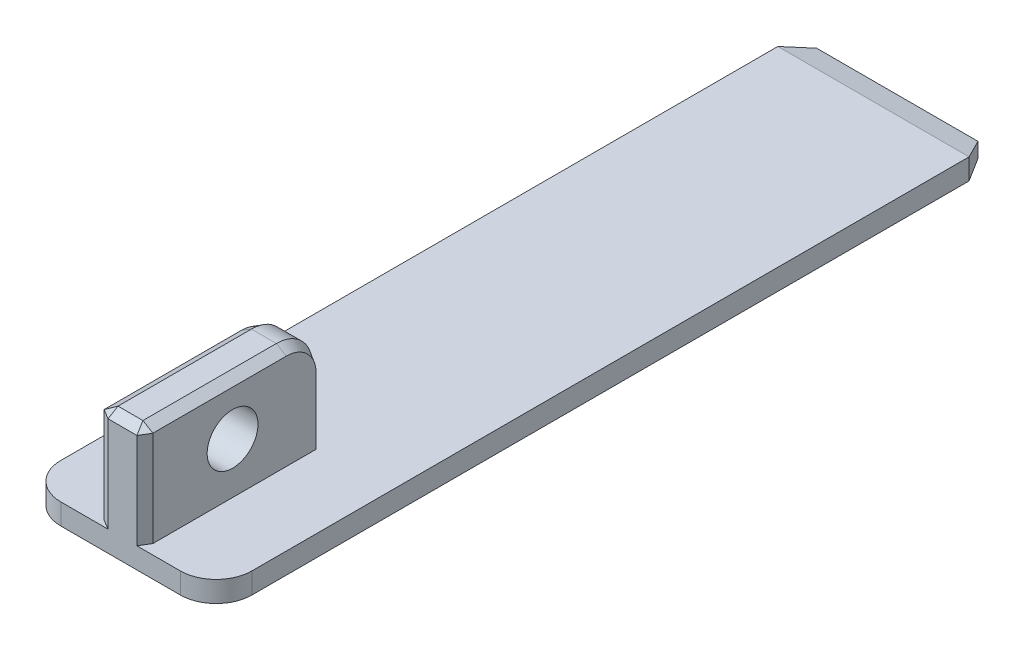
ISO-10303-21;
HEADER;
FILE_DESCRIPTION(('STEP AP214'),'2;1');
FILE_NAME('part.step','',(''),(''),'','','');
FILE_SCHEMA(('AUTOMOTIVE_DESIGN { 1 0 10303 214 1 1 1 1 }'));
ENDSEC;
DATA;
#1=APPLICATION_CONTEXT('core data for automotive mechanical design processes');
#2=APPLICATION_PROTOCOL_DEFINITION('international standard','automotive_design',2000,#1);
#3=PRODUCT_CONTEXT('',#1,'mechanical');
#4=PRODUCT('Part','Part','',(#3));
#5=PRODUCT_RELATED_PRODUCT_CATEGORY('part','',(#4));
#6=PRODUCT_DEFINITION_FORMATION('','',#4);
#7=PRODUCT_DEFINITION_CONTEXT('part definition',#1,'design');
#8=PRODUCT_DEFINITION('design','',#6,#7);
#9=PRODUCT_DEFINITION_SHAPE('','',#8);
#10=(LENGTH_UNIT() NAMED_UNIT(*) SI_UNIT(.MILLI.,.METRE.));
#11=(NAMED_UNIT(*) PLANE_ANGLE_UNIT() SI_UNIT($,.RADIAN.));
#12=(NAMED_UNIT(*) SI_UNIT($,.STERADIAN.) SOLID_ANGLE_UNIT());
#13=UNCERTAINTY_MEASURE_WITH_UNIT(LENGTH_MEASURE(1.E-05),#10,'distance_accuracy_value','');
#14=(GEOMETRIC_REPRESENTATION_CONTEXT(3) GLOBAL_UNCERTAINTY_ASSIGNED_CONTEXT((#13)) GLOBAL_UNIT_ASSIGNED_CONTEXT((#10,
#11,#12)) REPRESENTATION_CONTEXT('',''));
#15=CARTESIAN_POINT('',(0.,0.,0.));
#16=DIRECTION('',(0.,0.,1.));
#17=DIRECTION('',(1.,0.,0.));
#18=AXIS2_PLACEMENT_3D('',#15,#16,#17);
#19=CARTESIAN_POINT('',(-16.,1.75,130.));
#20=DIRECTION('',(0.,-1.,0.));
#21=DIRECTION('',(0.,0.,-1.));
#22=AXIS2_PLACEMENT_3D('',#19,#20,#21);
#23=PLANE('',#22);
#24=DIRECTION('',(0.,0.,-1.));
#25=VECTOR('',#24,1.);
#26=CARTESIAN_POINT('',(-16.,1.75,130.));
#27=LINE('',#26,#25);
#28=CARTESIAN_POINT('',(-16.,1.75,124.));
#29=VERTEX_POINT('',#28);
#30=CARTESIAN_POINT('',(-16.,1.75,4.00000000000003));
#31=VERTEX_POINT('',#30);
#32=EDGE_CURVE('E184',#29,#31,#27,.T.);
#33=ORIENTED_EDGE('',*,*,#32,.F.);
#34=CARTESIAN_POINT('',(-10.,1.75,124.));
#35=DIRECTION('',(0.,-1.,0.));
#36=DIRECTION('',(0.,0.,-1.));
#37=AXIS2_PLACEMENT_3D('',#34,#35,#36);
#38=CIRCLE('',#37,6.);
#39=CARTESIAN_POINT('',(-10.,1.75,130.));
#40=VERTEX_POINT('',#39);
#41=EDGE_CURVE('E245',#29,#40,#38,.F.);
#42=ORIENTED_EDGE('',*,*,#41,.T.);
#43=DIRECTION('',(-1.,0.,0.));
#44=VECTOR('',#43,1.);
#45=CARTESIAN_POINT('',(-16.,1.75,130.));
#46=LINE('',#45,#44);
#47=CARTESIAN_POINT('',(-2.0857205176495,1.75,130.));
#48=VERTEX_POINT('',#47);
#49=EDGE_CURVE('E341',#48,#40,#46,.T.);
#50=ORIENTED_EDGE('',*,*,#49,.F.);
#51=DIRECTION('',(-0.857167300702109,0.,-0.515038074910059));
#52=VECTOR('',#51,1.);
#53=CARTESIAN_POINT('',(-12.3090395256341,1.75,123.857210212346));
#54=LINE('',#53,#52);
#55=CARTESIAN_POINT('',(-3.75,1.75,129.));
#56=VERTEX_POINT('',#55);
#57=EDGE_CURVE('E11',#48,#56,#54,.T.);
#58=ORIENTED_EDGE('',*,*,#57,.T.);
#59=DIRECTION('',(0.,0.,1.));
#60=VECTOR('',#59,1.);
#61=CARTESIAN_POINT('',(-3.75,1.75,130.));
#62=LINE('',#61,#60);
#63=CARTESIAN_POINT('',(-3.75,1.75,101.));
#64=VERTEX_POINT('',#63);
#65=EDGE_CURVE('E334',#64,#56,#62,.T.);
#66=ORIENTED_EDGE('',*,*,#65,.F.);
#67=DIRECTION('',(-0.857167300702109,0.,0.515038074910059));
#68=VECTOR('',#67,1.);
#69=CARTESIAN_POINT('',(-25.553253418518,1.75,114.100716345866));
#70=LINE('',#69,#68);
#71=CARTESIAN_POINT('',(-2.0857205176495,1.75,100.));
#72=VERTEX_POINT('',#71);
#73=EDGE_CURVE('E287',#64,#72,#70,.F.);
#74=ORIENTED_EDGE('',*,*,#73,.T.);
#75=DIRECTION('',(-1.,0.,0.));
#76=VECTOR('',#75,1.);
#77=CARTESIAN_POINT('',(-3.75,1.75,100.));
#78=LINE('',#77,#76);
#79=CARTESIAN_POINT('',(2.0857205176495,1.75,100.));
#80=VERTEX_POINT('',#79);
#81=EDGE_CURVE('E331',#80,#72,#78,.T.);
#82=ORIENTED_EDGE('',*,*,#81,.F.);
#83=DIRECTION('',(-0.857167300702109,0.,-0.515038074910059));
#84=VECTOR('',#83,1.);
#85=CARTESIAN_POINT('',(2.04170841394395,1.75,99.9735548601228));
#86=LINE('',#85,#84);
#87=CARTESIAN_POINT('',(3.75,1.75,101.));
#88=VERTEX_POINT('',#87);
#89=EDGE_CURVE('E285',#80,#88,#86,.F.);
#90=ORIENTED_EDGE('',*,*,#89,.T.);
#91=DIRECTION('',(0.,0.,-1.));
#92=VECTOR('',#91,1.);
#93=CARTESIAN_POINT('',(3.75,1.75,130.));
#94=LINE('',#93,#92);
#95=CARTESIAN_POINT('',(3.75,1.75,128.33572051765));
#96=VERTEX_POINT('',#95);
#97=EDGE_CURVE('E226',#96,#88,#94,.T.);
#98=ORIENTED_EDGE('',*,*,#97,.F.);
#99=DIRECTION('',(-0.515038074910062,0.,0.857167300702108));
#100=VECTOR('',#99,1.);
#101=CARTESIAN_POINT('',(-2.22370409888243,1.75,138.277633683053));
#102=LINE('',#101,#100);
#103=CARTESIAN_POINT('',(2.75,1.75,130.));
#104=VERTEX_POINT('',#103);
#105=EDGE_CURVE('E51',#96,#104,#102,.T.);
#106=ORIENTED_EDGE('',*,*,#105,.T.);
#107=CARTESIAN_POINT('',(10.,1.75,130.));
#108=VERTEX_POINT('',#107);
#109=EDGE_CURVE('E338',#108,#104,#46,.T.);
#110=ORIENTED_EDGE('',*,*,#109,.F.);
#111=CARTESIAN_POINT('',(10.,1.75,124.));
#112=DIRECTION('',(0.,-1.,0.));
#113=DIRECTION('',(0.,0.,-1.));
#114=AXIS2_PLACEMENT_3D('',#111,#112,#113);
#115=CIRCLE('',#114,6.);
#116=CARTESIAN_POINT('',(16.,1.75,124.));
#117=VERTEX_POINT('',#116);
#118=EDGE_CURVE('E243',#108,#117,#115,.F.);
#119=ORIENTED_EDGE('',*,*,#118,.T.);
#120=DIRECTION('',(0.,0.,-1.));
#121=VECTOR('',#120,1.);
#122=CARTESIAN_POINT('',(16.,1.75,130.));
#123=LINE('',#122,#121);
#124=CARTESIAN_POINT('',(16.,1.75,4.00000000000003));
#125=VERTEX_POINT('',#124);
#126=EDGE_CURVE('E200',#117,#125,#123,.T.);
#127=ORIENTED_EDGE('',*,*,#126,.T.);
#128=DIRECTION('',(-1.,0.,0.));
#129=VECTOR('',#128,1.);
#130=CARTESIAN_POINT('',(-16.,1.75,4.00000000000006));
#131=LINE('',#130,#129);
#132=EDGE_CURVE('E212',#125,#31,#131,.T.);
#133=ORIENTED_EDGE('',*,*,#132,.T.);
#134=EDGE_LOOP('',(#33,#42,#50,#58,#66,#74,#82,#90,#98,#106,#110,#119,#127,#133));
#135=FACE_BOUND('',#134,.T.);
#136=ADVANCED_FACE('F41',(#135),#23,.F.);
#137=CARTESIAN_POINT('',(16.,1.75,130.));
#138=DIRECTION('',(-1.,0.,0.));
#139=DIRECTION('',(0.,0.,1.));
#140=AXIS2_PLACEMENT_3D('',#137,#138,#139);
#141=PLANE('',#140);
#142=ORIENTED_EDGE('',*,*,#126,.F.);
#143=DIRECTION('',(0.,1.,0.));
#144=VECTOR('',#143,1.);
#145=CARTESIAN_POINT('',(16.,-1.75,124.));
#146=LINE('',#145,#144);
#147=CARTESIAN_POINT('',(16.,-1.75,124.));
#148=VERTEX_POINT('',#147);
#149=EDGE_CURVE('E247',#117,#148,#146,.F.);
#150=ORIENTED_EDGE('',*,*,#149,.T.);
#151=DIRECTION('',(0.,0.,-1.));
#152=VECTOR('',#151,1.);
#153=CARTESIAN_POINT('',(16.,-1.75,130.));
#154=LINE('',#153,#152);
#155=CARTESIAN_POINT('',(16.,-1.75,4.00000000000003));
#156=VERTEX_POINT('',#155);
#157=EDGE_CURVE('E185',#148,#156,#154,.T.);
#158=ORIENTED_EDGE('',*,*,#157,.T.);
#159=DIRECTION('',(0.,1.,0.));
#160=VECTOR('',#159,1.);
#161=CARTESIAN_POINT('',(16.,1.75,4.00000000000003));
#162=LINE('',#161,#160);
#163=EDGE_CURVE('E209',#156,#125,#162,.T.);
#164=ORIENTED_EDGE('',*,*,#163,.T.);
#165=EDGE_LOOP('',(#142,#150,#158,#164));
#166=FACE_BOUND('',#165,.T.);
#167=ADVANCED_FACE('F348',(#166),#141,.F.);
#168=CARTESIAN_POINT('',(-16.,1.75,130.));
#169=DIRECTION('',(1.,0.,0.));
#170=DIRECTION('',(0.,0.,-1.));
#171=AXIS2_PLACEMENT_3D('',#168,#169,#170);
#172=PLANE('',#171);
#173=DIRECTION('',(0.,0.,-1.));
#174=VECTOR('',#173,1.);
#175=CARTESIAN_POINT('',(-16.,-1.75,130.));
#176=LINE('',#175,#174);
#177=CARTESIAN_POINT('',(-16.,-1.75,124.));
#178=VERTEX_POINT('',#177);
#179=CARTESIAN_POINT('',(-16.,-1.75,4.00000000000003));
#180=VERTEX_POINT('',#179);
#181=EDGE_CURVE('E173',#178,#180,#176,.T.);
#182=ORIENTED_EDGE('',*,*,#181,.F.);
#183=DIRECTION('',(0.,-1.,0.));
#184=VECTOR('',#183,1.);
#185=CARTESIAN_POINT('',(-16.,1.75,124.));
#186=LINE('',#185,#184);
#187=EDGE_CURVE('E241',#178,#29,#186,.F.);
#188=ORIENTED_EDGE('',*,*,#187,.T.);
#189=ORIENTED_EDGE('',*,*,#32,.T.);
#190=DIRECTION('',(0.,-1.,0.));
#191=VECTOR('',#190,1.);
#192=CARTESIAN_POINT('',(-16.,1.75,4.00000000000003));
#193=LINE('',#192,#191);
#194=EDGE_CURVE('E191',#31,#180,#193,.T.);
#195=ORIENTED_EDGE('',*,*,#194,.T.);
#196=EDGE_LOOP('',(#182,#188,#189,#195));
#197=FACE_BOUND('',#196,.T.);
#198=ADVANCED_FACE('F197',(#197),#172,.F.);
#199=CARTESIAN_POINT('',(-16.,-1.75,130.));
#200=DIRECTION('',(0.,1.,0.));
#201=DIRECTION('',(0.,0.,1.));
#202=AXIS2_PLACEMENT_3D('',#199,#200,#201);
#203=PLANE('',#202);
#204=DIRECTION('',(1.,0.,0.));
#205=VECTOR('',#204,1.);
#206=CARTESIAN_POINT('',(-16.,-1.75,130.));
#207=LINE('',#206,#205);
#208=CARTESIAN_POINT('',(-10.,-1.75,130.));
#209=VERTEX_POINT('',#208);
#210=CARTESIAN_POINT('',(10.,-1.75,130.));
#211=VERTEX_POINT('',#210);
#212=EDGE_CURVE('E340',#209,#211,#207,.T.);
#213=ORIENTED_EDGE('',*,*,#212,.F.);
#214=CARTESIAN_POINT('',(-10.,-1.75,124.));
#215=DIRECTION('',(0.,1.,0.));
#216=DIRECTION('',(0.,0.,1.));
#217=AXIS2_PLACEMENT_3D('',#214,#215,#216);
#218=CIRCLE('',#217,6.);
#219=EDGE_CURVE('E180',#209,#178,#218,.F.);
#220=ORIENTED_EDGE('',*,*,#219,.T.);
#221=ORIENTED_EDGE('',*,*,#181,.T.);
#222=DIRECTION('',(-0.52999894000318,0.,0.847998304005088));
#223=VECTOR('',#222,1.);
#224=CARTESIAN_POINT('',(-16.,-1.75,4.00000000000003));
#225=LINE('',#224,#223);
#226=CARTESIAN_POINT('',(-13.5,-1.75,0.));
#227=VERTEX_POINT('',#226);
#228=EDGE_CURVE('E178',#180,#227,#225,.F.);
#229=ORIENTED_EDGE('',*,*,#228,.T.);
#230=DIRECTION('',(1.,0.,0.));
#231=VECTOR('',#230,1.);
#232=CARTESIAN_POINT('',(-16.,-1.75,0.));
#233=LINE('',#232,#231);
#234=CARTESIAN_POINT('',(13.5,-1.75,0.));
#235=VERTEX_POINT('',#234);
#236=EDGE_CURVE('E337',#227,#235,#233,.T.);
#237=ORIENTED_EDGE('',*,*,#236,.T.);
#238=DIRECTION('',(-0.52999894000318,0.,-0.847998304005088));
#239=VECTOR('',#238,1.);
#240=CARTESIAN_POINT('',(16.,-1.75,4.00000000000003));
#241=LINE('',#240,#239);
#242=EDGE_CURVE('E195',#235,#156,#241,.F.);
#243=ORIENTED_EDGE('',*,*,#242,.T.);
#244=ORIENTED_EDGE('',*,*,#157,.F.);
#245=CARTESIAN_POINT('',(10.,-1.75,124.));
#246=DIRECTION('',(0.,1.,0.));
#247=DIRECTION('',(0.,0.,1.));
#248=AXIS2_PLACEMENT_3D('',#245,#246,#247);
#249=CIRCLE('',#248,6.);
#250=EDGE_CURVE('E238',#148,#211,#249,.F.);
#251=ORIENTED_EDGE('',*,*,#250,.T.);
#252=EDGE_LOOP('',(#213,#220,#221,#229,#237,#243,#244,#251));
#253=FACE_BOUND('',#252,.T.);
#254=ADVANCED_FACE('F176',(#253),#203,.F.);
#255=CARTESIAN_POINT('',(0.,0.,130.));
#256=DIRECTION('',(0.,0.,1.));
#257=DIRECTION('',(1.,0.,0.));
#258=AXIS2_PLACEMENT_3D('',#255,#256,#257);
#259=PLANE('',#258);
#260=DIRECTION('',(0.,-1.,0.));
#261=VECTOR('',#260,1.);
#262=CARTESIAN_POINT('',(-2.0857205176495,1.75,130.));
#263=LINE('',#262,#261);
#264=CARTESIAN_POINT('',(-2.0857205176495,17.75,130.));
#265=VERTEX_POINT('',#264);
#266=EDGE_CURVE('E276',#265,#48,#263,.T.);
#267=ORIENTED_EDGE('',*,*,#266,.T.);
#268=ORIENTED_EDGE('',*,*,#49,.T.);
#269=DIRECTION('',(0.,-1.,0.));
#270=VECTOR('',#269,1.);
#271=CARTESIAN_POINT('',(-10.,-1.75,130.));
#272=LINE('',#271,#270);
#273=EDGE_CURVE('E235',#40,#209,#272,.T.);
#274=ORIENTED_EDGE('',*,*,#273,.T.);
#275=ORIENTED_EDGE('',*,*,#212,.T.);
#276=DIRECTION('',(0.,1.,0.));
#277=VECTOR('',#276,1.);
#278=CARTESIAN_POINT('',(10.,1.75,130.));
#279=LINE('',#278,#277);
#280=EDGE_CURVE('E232',#211,#108,#279,.T.);
#281=ORIENTED_EDGE('',*,*,#280,.T.);
#282=ORIENTED_EDGE('',*,*,#109,.T.);
#283=DIRECTION('',(0.,1.,0.));
#284=VECTOR('',#283,1.);
#285=CARTESIAN_POINT('',(2.75,18.75,130.));
#286=LINE('',#285,#284);
#287=CARTESIAN_POINT('',(2.75,17.75,130.));
#288=VERTEX_POINT('',#287);
#289=EDGE_CURVE('E279',#104,#288,#286,.T.);
#290=ORIENTED_EDGE('',*,*,#289,.T.);
#291=DIRECTION('',(-1.,0.,0.));
#292=VECTOR('',#291,1.);
#293=CARTESIAN_POINT('',(-3.75,17.75,130.));
#294=LINE('',#293,#292);
#295=EDGE_CURVE('E274',#288,#265,#294,.T.);
#296=ORIENTED_EDGE('',*,*,#295,.T.);
#297=EDGE_LOOP('',(#267,#268,#274,#275,#281,#282,#290,#296));
#298=FACE_BOUND('',#297,.T.);
#299=ADVANCED_FACE('F368',(#298),#259,.T.);
#300=CARTESIAN_POINT('',(0.,0.,0.));
#301=DIRECTION('',(0.,0.,1.));
#302=DIRECTION('',(1.,0.,0.));
#303=AXIS2_PLACEMENT_3D('',#300,#301,#302);
#304=PLANE('',#303);
#305=DIRECTION('',(0.,1.,0.));
#306=VECTOR('',#305,1.);
#307=CARTESIAN_POINT('',(-13.5,0.,0.));
#308=LINE('',#307,#306);
#309=CARTESIAN_POINT('',(-13.5,0.749999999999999,0.));
#310=VERTEX_POINT('',#309);
#311=EDGE_CURVE('E193',#227,#310,#308,.T.);
#312=ORIENTED_EDGE('',*,*,#311,.T.);
#313=DIRECTION('',(1.,0.,0.));
#314=VECTOR('',#313,1.);
#315=CARTESIAN_POINT('',(0.,0.749999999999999,0.));
#316=LINE('',#315,#314);
#317=CARTESIAN_POINT('',(13.5,0.749999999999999,0.));
#318=VERTEX_POINT('',#317);
#319=EDGE_CURVE('E217',#310,#318,#316,.T.);
#320=ORIENTED_EDGE('',*,*,#319,.T.);
#321=DIRECTION('',(0.,-1.,0.));
#322=VECTOR('',#321,1.);
#323=CARTESIAN_POINT('',(13.5,0.,0.));
#324=LINE('',#323,#322);
#325=EDGE_CURVE('E194',#318,#235,#324,.T.);
#326=ORIENTED_EDGE('',*,*,#325,.T.);
#327=ORIENTED_EDGE('',*,*,#236,.F.);
#328=EDGE_LOOP('',(#312,#320,#326,#327));
#329=FACE_BOUND('',#328,.T.);
#330=ADVANCED_FACE('F451',(#329),#304,.F.);
#331=CARTESIAN_POINT('',(-16.,1.75,4.00000000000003));
#332=DIRECTION('',(0.847998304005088,0.,0.529998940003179));
#333=DIRECTION('',(0.,-1.,0.));
#334=AXIS2_PLACEMENT_3D('',#331,#332,#333);
#335=PLANE('',#334);
#336=ORIENTED_EDGE('',*,*,#194,.F.);
#337=DIRECTION('',(0.518475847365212,-0.207390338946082,-0.829561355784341));
#338=VECTOR('',#337,1.);
#339=CARTESIAN_POINT('',(-16.,1.75,4.00000000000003));
#340=LINE('',#339,#338);
#341=EDGE_CURVE('E215',#31,#310,#340,.T.);
#342=ORIENTED_EDGE('',*,*,#341,.T.);
#343=ORIENTED_EDGE('',*,*,#311,.F.);
#344=ORIENTED_EDGE('',*,*,#228,.F.);
#345=EDGE_LOOP('',(#336,#342,#343,#344));
#346=FACE_BOUND('',#345,.T.);
#347=ADVANCED_FACE('F190',(#346),#335,.F.);
#348=CARTESIAN_POINT('',(16.,1.75,4.00000000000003));
#349=DIRECTION('',(-0.847998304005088,0.,0.529998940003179));
#350=DIRECTION('',(0.,1.,0.));
#351=AXIS2_PLACEMENT_3D('',#348,#349,#350);
#352=PLANE('',#351);
#353=ORIENTED_EDGE('',*,*,#325,.F.);
#354=DIRECTION('',(0.518475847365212,0.207390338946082,0.829561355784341));
#355=VECTOR('',#354,1.);
#356=CARTESIAN_POINT('',(16.,1.75,4.00000000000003));
#357=LINE('',#356,#355);
#358=EDGE_CURVE('E219',#318,#125,#357,.T.);
#359=ORIENTED_EDGE('',*,*,#358,.T.);
#360=ORIENTED_EDGE('',*,*,#163,.F.);
#361=ORIENTED_EDGE('',*,*,#242,.F.);
#362=EDGE_LOOP('',(#353,#359,#360,#361));
#363=FACE_BOUND('',#362,.T.);
#364=ADVANCED_FACE('F356',(#363),#352,.F.);
#365=CARTESIAN_POINT('',(-16.,1.75,4.00000000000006));
#366=DIRECTION('',(0.,-0.970142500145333,0.24253562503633));
#367=DIRECTION('',(-1.,0.,0.));
#368=AXIS2_PLACEMENT_3D('',#365,#366,#367);
#369=PLANE('',#368);
#370=ORIENTED_EDGE('',*,*,#358,.F.);
#371=ORIENTED_EDGE('',*,*,#319,.F.);
#372=ORIENTED_EDGE('',*,*,#341,.F.);
#373=ORIENTED_EDGE('',*,*,#132,.F.);
#374=EDGE_LOOP('',(#370,#371,#372,#373));
#375=FACE_BOUND('',#374,.T.);
#376=ADVANCED_FACE('F360',(#375),#369,.F.);
#377=CARTESIAN_POINT('',(3.75,18.75,130.));
#378=DIRECTION('',(-1.,0.,0.));
#379=DIRECTION('',(0.,0.,1.));
#380=AXIS2_PLACEMENT_3D('',#377,#378,#379);
#381=PLANE('',#380);
#382=ORIENTED_EDGE('',*,*,#97,.T.);
#383=DIRECTION('',(0.,1.,0.));
#384=VECTOR('',#383,1.);
#385=CARTESIAN_POINT('',(3.75,18.75,101.));
#386=LINE('',#385,#384);
#387=CARTESIAN_POINT('',(3.75,12.75,101.));
#388=VERTEX_POINT('',#387);
#389=EDGE_CURVE('E260',#88,#388,#386,.T.);
#390=ORIENTED_EDGE('',*,*,#389,.T.);
#391=CARTESIAN_POINT('',(3.75,12.75,106.));
#392=DIRECTION('',(-1.,0.,0.));
#393=DIRECTION('',(0.,0.,1.));
#394=AXIS2_PLACEMENT_3D('',#391,#392,#393);
#395=CIRCLE('',#394,5.);
#396=CARTESIAN_POINT('',(3.75,17.75,106.));
#397=VERTEX_POINT('',#396);
#398=EDGE_CURVE('E258',#388,#397,#395,.F.);
#399=ORIENTED_EDGE('',*,*,#398,.T.);
#400=DIRECTION('',(0.,0.,1.));
#401=VECTOR('',#400,1.);
#402=CARTESIAN_POINT('',(3.75,17.75,130.));
#403=LINE('',#402,#401);
#404=CARTESIAN_POINT('',(3.75,17.75,128.33572051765));
#405=VERTEX_POINT('',#404);
#406=EDGE_CURVE('E254',#397,#405,#403,.T.);
#407=ORIENTED_EDGE('',*,*,#406,.T.);
#408=DIRECTION('',(0.,-1.,0.));
#409=VECTOR('',#408,1.);
#410=CARTESIAN_POINT('',(3.75,1.75,128.33572051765));
#411=LINE('',#410,#409);
#412=EDGE_CURVE('E256',#405,#96,#411,.T.);
#413=ORIENTED_EDGE('',*,*,#412,.T.);
#414=EDGE_LOOP('',(#382,#390,#399,#407,#413));
#415=FACE_BOUND('',#414,.T.);
#416=CARTESIAN_POINT('',(3.74999999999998,10.25,115.));
#417=DIRECTION('',(1.,0.,0.));
#418=DIRECTION('',(0.,0.,-1.));
#419=AXIS2_PLACEMENT_3D('',#416,#417,#418);
#420=CIRCLE('',#419,4.25000000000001);
#421=CARTESIAN_POINT('',(3.74999999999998,10.25,110.75));
#422=VERTEX_POINT('',#421);
#423=EDGE_CURVE('E227',#422,#422,#420,.T.);
#424=ORIENTED_EDGE('',*,*,#423,.F.);
#425=EDGE_LOOP('',(#424));
#426=FACE_BOUND('',#425,.T.);
#427=ADVANCED_FACE('F420',(#415,#426),#381,.F.);
#428=CARTESIAN_POINT('',(-3.75,18.75,100.));
#429=DIRECTION('',(0.,0.,1.));
#430=DIRECTION('',(1.,0.,0.));
#431=AXIS2_PLACEMENT_3D('',#428,#429,#430);
#432=PLANE('',#431);
#433=DIRECTION('',(-1.,0.,0.));
#434=VECTOR('',#433,1.);
#435=CARTESIAN_POINT('',(-3.75,12.75,100.));
#436=LINE('',#435,#434);
#437=CARTESIAN_POINT('',(-2.0857205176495,12.75,100.));
#438=VERTEX_POINT('',#437);
#439=CARTESIAN_POINT('',(2.0857205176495,12.75,100.));
#440=VERTEX_POINT('',#439);
#441=EDGE_CURVE('E229',#438,#440,#436,.F.);
#442=ORIENTED_EDGE('',*,*,#441,.T.);
#443=DIRECTION('',(0.,-1.,0.));
#444=VECTOR('',#443,1.);
#445=CARTESIAN_POINT('',(2.0857205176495,18.75,100.));
#446=LINE('',#445,#444);
#447=EDGE_CURVE('E251',#440,#80,#446,.T.);
#448=ORIENTED_EDGE('',*,*,#447,.T.);
#449=ORIENTED_EDGE('',*,*,#81,.T.);
#450=DIRECTION('',(0.,1.,0.));
#451=VECTOR('',#450,1.);
#452=CARTESIAN_POINT('',(-2.0857205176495,18.75,100.));
#453=LINE('',#452,#451);
#454=EDGE_CURVE('E249',#72,#438,#453,.T.);
#455=ORIENTED_EDGE('',*,*,#454,.T.);
#456=EDGE_LOOP('',(#442,#448,#449,#455));
#457=FACE_BOUND('',#456,.T.);
#458=ADVANCED_FACE('F411',(#457),#432,.F.);
#459=CARTESIAN_POINT('',(-3.75,18.75,130.));
#460=DIRECTION('',(1.,0.,0.));
#461=DIRECTION('',(0.,0.,-1.));
#462=AXIS2_PLACEMENT_3D('',#459,#460,#461);
#463=PLANE('',#462);
#464=CARTESIAN_POINT('',(-3.75,10.25,115.));
#465=DIRECTION('',(1.,0.,0.));
#466=DIRECTION('',(0.,0.,-1.));
#467=AXIS2_PLACEMENT_3D('',#464,#465,#466);
#468=CIRCLE('',#467,4.25000000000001);
#469=CARTESIAN_POINT('',(-3.75,10.25,110.75));
#470=VERTEX_POINT('',#469);
#471=EDGE_CURVE('E223',#470,#470,#468,.T.);
#472=ORIENTED_EDGE('',*,*,#471,.T.);
#473=EDGE_LOOP('',(#472));
#474=FACE_BOUND('',#473,.T.);
#475=CARTESIAN_POINT('',(-3.75,12.75,106.));
#476=DIRECTION('',(1.,0.,0.));
#477=DIRECTION('',(0.,0.,-1.));
#478=AXIS2_PLACEMENT_3D('',#475,#476,#477);
#479=CIRCLE('',#478,5.);
#480=CARTESIAN_POINT('',(-3.75,17.75,106.));
#481=VERTEX_POINT('',#480);
#482=CARTESIAN_POINT('',(-3.75,12.75,101.));
#483=VERTEX_POINT('',#482);
#484=EDGE_CURVE('E266',#481,#483,#479,.F.);
#485=ORIENTED_EDGE('',*,*,#484,.T.);
#486=DIRECTION('',(0.,-1.,0.));
#487=VECTOR('',#486,1.);
#488=CARTESIAN_POINT('',(-3.75,18.75,101.));
#489=LINE('',#488,#487);
#490=EDGE_CURVE('E268',#483,#64,#489,.T.);
#491=ORIENTED_EDGE('',*,*,#490,.T.);
#492=ORIENTED_EDGE('',*,*,#65,.T.);
#493=DIRECTION('',(0.,1.,0.));
#494=VECTOR('',#493,1.);
#495=CARTESIAN_POINT('',(-3.75,18.75,129.));
#496=LINE('',#495,#494);
#497=CARTESIAN_POINT('',(-3.75,17.75,129.));
#498=VERTEX_POINT('',#497);
#499=EDGE_CURVE('E264',#56,#498,#496,.T.);
#500=ORIENTED_EDGE('',*,*,#499,.T.);
#501=DIRECTION('',(0.,0.,-1.));
#502=VECTOR('',#501,1.);
#503=CARTESIAN_POINT('',(-3.75,17.75,130.));
#504=LINE('',#503,#502);
#505=EDGE_CURVE('E262',#498,#481,#504,.T.);
#506=ORIENTED_EDGE('',*,*,#505,.T.);
#507=EDGE_LOOP('',(#485,#491,#492,#500,#506));
#508=FACE_BOUND('',#507,.T.);
#509=ADVANCED_FACE('F382',(#474,#508),#463,.F.);
#510=CARTESIAN_POINT('',(0.,18.75,0.));
#511=DIRECTION('',(0.,-1.,0.));
#512=DIRECTION('',(0.,0.,-1.));
#513=AXIS2_PLACEMENT_3D('',#510,#511,#512);
#514=PLANE('',#513);
#515=DIRECTION('',(1.,0.,0.));
#516=VECTOR('',#515,1.);
#517=CARTESIAN_POINT('',(3.75,18.75,128.33572051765));
#518=LINE('',#517,#516);
#519=CARTESIAN_POINT('',(-2.0857205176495,18.75,128.33572051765));
#520=VERTEX_POINT('',#519);
#521=CARTESIAN_POINT('',(2.0857205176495,18.75,128.33572051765));
#522=VERTEX_POINT('',#521);
#523=EDGE_CURVE('E59',#520,#522,#518,.T.);
#524=ORIENTED_EDGE('',*,*,#523,.T.);
#525=DIRECTION('',(0.,0.,-1.));
#526=VECTOR('',#525,1.);
#527=CARTESIAN_POINT('',(2.0857205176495,18.75,0.));
#528=LINE('',#527,#526);
#529=CARTESIAN_POINT('',(2.0857205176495,18.75,106.));
#530=VERTEX_POINT('',#529);
#531=EDGE_CURVE('E283',#522,#530,#528,.T.);
#532=ORIENTED_EDGE('',*,*,#531,.T.);
#533=DIRECTION('',(-1.,0.,0.));
#534=VECTOR('',#533,1.);
#535=CARTESIAN_POINT('',(0.,18.75,106.));
#536=LINE('',#535,#534);
#537=CARTESIAN_POINT('',(-2.0857205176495,18.75,106.));
#538=VERTEX_POINT('',#537);
#539=EDGE_CURVE('E222',#530,#538,#536,.T.);
#540=ORIENTED_EDGE('',*,*,#539,.T.);
#541=DIRECTION('',(0.,0.,1.));
#542=VECTOR('',#541,1.);
#543=CARTESIAN_POINT('',(-2.0857205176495,18.75,0.));
#544=LINE('',#543,#542);
#545=EDGE_CURVE('E64',#538,#520,#544,.T.);
#546=ORIENTED_EDGE('',*,*,#545,.T.);
#547=EDGE_LOOP('',(#524,#532,#540,#546));
#548=FACE_BOUND('',#547,.T.);
#549=ADVANCED_FACE('F400',(#548),#514,.F.);
#550=CARTESIAN_POINT('',(-16.,10.25,115.));
#551=DIRECTION('',(1.,0.,0.));
#552=DIRECTION('',(0.,0.,-1.));
#553=AXIS2_PLACEMENT_3D('',#550,#551,#552);
#554=CYLINDRICAL_SURFACE('',#553,4.25000000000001);
#555=ORIENTED_EDGE('',*,*,#423,.T.);
#556=EDGE_LOOP('',(#555));
#557=FACE_BOUND('',#556,.T.);
#558=ORIENTED_EDGE('',*,*,#471,.F.);
#559=EDGE_LOOP('',(#558));
#560=FACE_BOUND('',#559,.T.);
#561=ADVANCED_FACE('F463',(#557,#560),#554,.F.);
#562=CARTESIAN_POINT('',(0.,12.75,106.));
#563=DIRECTION('',(-1.,0.,0.));
#564=DIRECTION('',(0.,0.,1.));
#565=AXIS2_PLACEMENT_3D('',#562,#563,#564);
#566=CYLINDRICAL_SURFACE('',#565,6.);
#567=ORIENTED_EDGE('',*,*,#539,.F.);
#568=CARTESIAN_POINT('',(2.0857205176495,12.75,106.));
#569=DIRECTION('',(-1.,0.,0.));
#570=DIRECTION('',(0.,0.,1.));
#571=AXIS2_PLACEMENT_3D('',#568,#569,#570);
#572=CIRCLE('',#571,6.);
#573=EDGE_CURVE('E272',#530,#440,#572,.T.);
#574=ORIENTED_EDGE('',*,*,#573,.T.);
#575=ORIENTED_EDGE('',*,*,#441,.F.);
#576=CARTESIAN_POINT('',(-2.0857205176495,12.75,106.));
#577=DIRECTION('',(1.,0.,0.));
#578=DIRECTION('',(0.,0.,-1.));
#579=AXIS2_PLACEMENT_3D('',#576,#577,#578);
#580=CIRCLE('',#579,6.);
#581=EDGE_CURVE('E270',#438,#538,#580,.T.);
#582=ORIENTED_EDGE('',*,*,#581,.T.);
#583=EDGE_LOOP('',(#567,#574,#575,#582));
#584=FACE_BOUND('',#583,.T.);
#585=ADVANCED_FACE('F402',(#584),#566,.T.);
#586=CARTESIAN_POINT('',(-10.,0.,124.));
#587=DIRECTION('',(0.,1.,0.));
#588=DIRECTION('',(0.,0.,1.));
#589=AXIS2_PLACEMENT_3D('',#586,#587,#588);
#590=CYLINDRICAL_SURFACE('',#589,6.);
#591=ORIENTED_EDGE('',*,*,#41,.F.);
#592=ORIENTED_EDGE('',*,*,#187,.F.);
#593=ORIENTED_EDGE('',*,*,#219,.F.);
#594=ORIENTED_EDGE('',*,*,#273,.F.);
#595=EDGE_LOOP('',(#591,#592,#593,#594));
#596=FACE_BOUND('',#595,.T.);
#597=ADVANCED_FACE('F372',(#596),#590,.T.);
#598=CARTESIAN_POINT('',(10.,0.,124.));
#599=DIRECTION('',(0.,-1.,0.));
#600=DIRECTION('',(0.,0.,-1.));
#601=AXIS2_PLACEMENT_3D('',#598,#599,#600);
#602=CYLINDRICAL_SURFACE('',#601,6.);
#603=ORIENTED_EDGE('',*,*,#250,.F.);
#604=ORIENTED_EDGE('',*,*,#149,.F.);
#605=ORIENTED_EDGE('',*,*,#118,.F.);
#606=ORIENTED_EDGE('',*,*,#280,.F.);
#607=EDGE_LOOP('',(#603,#604,#605,#606));
#608=FACE_BOUND('',#607,.T.);
#609=ADVANCED_FACE('F365',(#608),#602,.T.);
#610=CARTESIAN_POINT('',(-3.75,18.75,101.));
#611=DIRECTION('',(0.515038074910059,0.,0.857167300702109));
#612=DIRECTION('',(0.,-1.,0.));
#613=AXIS2_PLACEMENT_3D('',#610,#611,#612);
#614=PLANE('',#613);
#615=ORIENTED_EDGE('',*,*,#73,.F.);
#616=ORIENTED_EDGE('',*,*,#490,.F.);
#617=DIRECTION('',(-0.857167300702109,0.,0.515038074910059));
#618=VECTOR('',#617,1.);
#619=CARTESIAN_POINT('',(-2.0857205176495,12.75,100.));
#620=LINE('',#619,#618);
#621=EDGE_CURVE('E46',#438,#483,#620,.T.);
#622=ORIENTED_EDGE('',*,*,#621,.F.);
#623=ORIENTED_EDGE('',*,*,#454,.F.);
#624=EDGE_LOOP('',(#615,#616,#622,#623));
#625=FACE_BOUND('',#624,.T.);
#626=ADVANCED_FACE('F44',(#625),#614,.F.);
#627=CARTESIAN_POINT('',(-3.75,12.75,106.));
#628=DIRECTION('',(1.,0.,0.));
#629=DIRECTION('',(0.,0.,-1.));
#630=AXIS2_PLACEMENT_3D('',#627,#628,#629);
#631=CONICAL_SURFACE('',#630,5.,0.541052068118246);
#632=ORIENTED_EDGE('',*,*,#621,.T.);
#633=ORIENTED_EDGE('',*,*,#484,.F.);
#634=DIRECTION('',(-0.857167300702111,-0.515038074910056,0.));
#635=VECTOR('',#634,1.);
#636=CARTESIAN_POINT('',(-2.0857205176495,18.75,106.));
#637=LINE('',#636,#635);
#638=EDGE_CURVE('E314',#538,#481,#637,.T.);
#639=ORIENTED_EDGE('',*,*,#638,.F.);
#640=ORIENTED_EDGE('',*,*,#581,.F.);
#641=EDGE_LOOP('',(#632,#633,#639,#640));
#642=FACE_BOUND('',#641,.T.);
#643=ADVANCED_FACE('F404',(#642),#631,.T.);
#644=CARTESIAN_POINT('',(-2.0857205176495,0.,130.));
#645=DIRECTION('',(-0.515038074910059,0.,0.857167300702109));
#646=DIRECTION('',(0.,1.,0.));
#647=AXIS2_PLACEMENT_3D('',#644,#645,#646);
#648=PLANE('',#647);
#649=ORIENTED_EDGE('',*,*,#57,.F.);
#650=ORIENTED_EDGE('',*,*,#266,.F.);
#651=DIRECTION('',(0.857167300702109,0.,0.515038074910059));
#652=VECTOR('',#651,1.);
#653=CARTESIAN_POINT('',(-3.75,17.75,129.));
#654=LINE('',#653,#652);
#655=EDGE_CURVE('E312',#498,#265,#654,.T.);
#656=ORIENTED_EDGE('',*,*,#655,.F.);
#657=ORIENTED_EDGE('',*,*,#499,.F.);
#658=EDGE_LOOP('',(#649,#650,#656,#657));
#659=FACE_BOUND('',#658,.T.);
#660=ADVANCED_FACE('F380',(#659),#648,.T.);
#661=CARTESIAN_POINT('',(-2.0857205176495,18.75,0.));
#662=DIRECTION('',(0.515038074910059,-0.857167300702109,0.));
#663=DIRECTION('',(0.,0.,1.));
#664=AXIS2_PLACEMENT_3D('',#661,#662,#663);
#665=PLANE('',#664);
#666=ORIENTED_EDGE('',*,*,#638,.T.);
#667=ORIENTED_EDGE('',*,*,#505,.F.);
#668=DIRECTION('',(0.811014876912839,0.487306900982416,-0.323707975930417));
#669=VECTOR('',#668,1.);
#670=CARTESIAN_POINT('',(-3.75,17.75,129.));
#671=LINE('',#670,#669);
#672=EDGE_CURVE('E309',#520,#498,#671,.F.);
#673=ORIENTED_EDGE('',*,*,#672,.F.);
#674=ORIENTED_EDGE('',*,*,#545,.F.);
#675=EDGE_LOOP('',(#666,#667,#673,#674));
#676=FACE_BOUND('',#675,.T.);
#677=ADVANCED_FACE('F383',(#676),#665,.F.);
#678=CARTESIAN_POINT('',(-3.75,17.75,129.));
#679=DIRECTION('',(-0.295633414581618,0.818853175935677,0.492016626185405));
#680=DIRECTION('',(0.,-0.515038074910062,0.857167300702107));
#681=AXIS2_PLACEMENT_3D('',#678,#679,#680);
#682=PLANE('',#681);
#683=ORIENTED_EDGE('',*,*,#672,.T.);
#684=ORIENTED_EDGE('',*,*,#655,.T.);
#685=DIRECTION('',(0.,0.515038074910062,-0.857167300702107));
#686=VECTOR('',#685,1.);
#687=CARTESIAN_POINT('',(-2.0857205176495,18.1914737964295,129.265264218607));
#688=LINE('',#687,#686);
#689=EDGE_CURVE('E306',#520,#265,#688,.F.);
#690=ORIENTED_EDGE('',*,*,#689,.F.);
#691=EDGE_LOOP('',(#683,#684,#690));
#692=FACE_BOUND('',#691,.T.);
#693=ADVANCED_FACE('F386',(#692),#682,.T.);
#694=CARTESIAN_POINT('',(3.75,18.75,128.33572051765));
#695=DIRECTION('',(0.857167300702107,0.,0.515038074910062));
#696=DIRECTION('',(0.,1.,0.));
#697=AXIS2_PLACEMENT_3D('',#694,#695,#696);
#698=PLANE('',#697);
#699=ORIENTED_EDGE('',*,*,#105,.F.);
#700=ORIENTED_EDGE('',*,*,#412,.F.);
#701=DIRECTION('',(0.515038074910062,0.,-0.857167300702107));
#702=VECTOR('',#701,1.);
#703=CARTESIAN_POINT('',(2.75,17.75,130.));
#704=LINE('',#703,#702);
#705=EDGE_CURVE('E303',#288,#405,#704,.T.);
#706=ORIENTED_EDGE('',*,*,#705,.F.);
#707=ORIENTED_EDGE('',*,*,#289,.F.);
#708=EDGE_LOOP('',(#699,#700,#706,#707));
#709=FACE_BOUND('',#708,.T.);
#710=ADVANCED_FACE('F425',(#709),#698,.T.);
#711=CARTESIAN_POINT('',(0.,18.75,128.33572051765));
#712=DIRECTION('',(0.,0.857167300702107,0.515038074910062));
#713=DIRECTION('',(-1.,0.,0.));
#714=AXIS2_PLACEMENT_3D('',#711,#712,#713);
#715=PLANE('',#714);
#716=ORIENTED_EDGE('',*,*,#689,.T.);
#717=ORIENTED_EDGE('',*,*,#295,.F.);
#718=DIRECTION('',(0.323707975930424,-0.487306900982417,0.811014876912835));
#719=VECTOR('',#718,1.);
#720=CARTESIAN_POINT('',(2.75,17.75,130.));
#721=LINE('',#720,#719);
#722=EDGE_CURVE('E300',#522,#288,#721,.T.);
#723=ORIENTED_EDGE('',*,*,#722,.F.);
#724=ORIENTED_EDGE('',*,*,#523,.F.);
#725=EDGE_LOOP('',(#716,#717,#723,#724));
#726=FACE_BOUND('',#725,.T.);
#727=ADVANCED_FACE('F388',(#726),#715,.T.);
#728=CARTESIAN_POINT('',(2.75,17.75,130.));
#729=DIRECTION('',(0.492016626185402,0.818853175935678,0.295633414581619));
#730=DIRECTION('',(-0.857167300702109,0.515038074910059,0.));
#731=AXIS2_PLACEMENT_3D('',#728,#729,#730);
#732=PLANE('',#731);
#733=ORIENTED_EDGE('',*,*,#722,.T.);
#734=ORIENTED_EDGE('',*,*,#705,.T.);
#735=DIRECTION('',(0.857167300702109,-0.515038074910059,0.));
#736=VECTOR('',#735,1.);
#737=CARTESIAN_POINT('',(3.01526421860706,18.1914737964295,128.33572051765));
#738=LINE('',#737,#736);
#739=EDGE_CURVE('E297',#522,#405,#738,.T.);
#740=ORIENTED_EDGE('',*,*,#739,.F.);
#741=EDGE_LOOP('',(#733,#734,#740));
#742=FACE_BOUND('',#741,.T.);
#743=ADVANCED_FACE('F393',(#742),#732,.T.);
#744=CARTESIAN_POINT('',(2.0857205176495,18.75,0.));
#745=DIRECTION('',(-0.515038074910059,-0.857167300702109,0.));
#746=DIRECTION('',(0.,0.,-1.));
#747=AXIS2_PLACEMENT_3D('',#744,#745,#746);
#748=PLANE('',#747);
#749=ORIENTED_EDGE('',*,*,#739,.T.);
#750=ORIENTED_EDGE('',*,*,#406,.F.);
#751=DIRECTION('',(0.857167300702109,-0.515038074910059,0.));
#752=VECTOR('',#751,1.);
#753=CARTESIAN_POINT('',(2.0857205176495,18.75,106.));
#754=LINE('',#753,#752);
#755=EDGE_CURVE('E294',#530,#397,#754,.T.);
#756=ORIENTED_EDGE('',*,*,#755,.F.);
#757=ORIENTED_EDGE('',*,*,#531,.F.);
#758=EDGE_LOOP('',(#749,#750,#756,#757));
#759=FACE_BOUND('',#758,.T.);
#760=ADVANCED_FACE('F397',(#759),#748,.F.);
#761=CARTESIAN_POINT('',(3.75,12.75,106.));
#762=DIRECTION('',(-1.,0.,0.));
#763=DIRECTION('',(0.,0.,1.));
#764=AXIS2_PLACEMENT_3D('',#761,#762,#763);
#765=CONICAL_SURFACE('',#764,5.,0.541052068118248);
#766=ORIENTED_EDGE('',*,*,#755,.T.);
#767=ORIENTED_EDGE('',*,*,#398,.F.);
#768=DIRECTION('',(0.857167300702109,0.,0.515038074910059));
#769=VECTOR('',#768,1.);
#770=CARTESIAN_POINT('',(2.0857205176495,12.75,100.));
#771=LINE('',#770,#769);
#772=EDGE_CURVE('E291',#440,#388,#771,.T.);
#773=ORIENTED_EDGE('',*,*,#772,.F.);
#774=ORIENTED_EDGE('',*,*,#573,.F.);
#775=EDGE_LOOP('',(#766,#767,#773,#774));
#776=FACE_BOUND('',#775,.T.);
#777=ADVANCED_FACE('F474',(#776),#765,.T.);
#778=CARTESIAN_POINT('',(2.0857205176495,18.75,100.));
#779=DIRECTION('',(-0.515038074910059,0.,0.857167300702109));
#780=DIRECTION('',(0.,-1.,0.));
#781=AXIS2_PLACEMENT_3D('',#778,#779,#780);
#782=PLANE('',#781);
#783=ORIENTED_EDGE('',*,*,#772,.T.);
#784=ORIENTED_EDGE('',*,*,#389,.F.);
#785=ORIENTED_EDGE('',*,*,#89,.F.);
#786=ORIENTED_EDGE('',*,*,#447,.F.);
#787=EDGE_LOOP('',(#783,#784,#785,#786));
#788=FACE_BOUND('',#787,.T.);
#789=ADVANCED_FACE('F415',(#788),#782,.F.);
#790=CLOSED_SHELL('',(#136,#167,#198,#254,#299,#330,#347,#364,#376,#427,#458,#509,#549,#561,
#585,#597,#609,#626,#643,#660,#677,#693,#710,#727,#743,#760,#777,#789));
#791=MANIFOLD_SOLID_BREP('B2',#790);
#792=ADVANCED_BREP_SHAPE_REPRESENTATION('',(#18,#791),#14);
#793=SHAPE_DEFINITION_REPRESENTATION(#9,#792);
ENDSEC;
END-ISO-10303-21;
